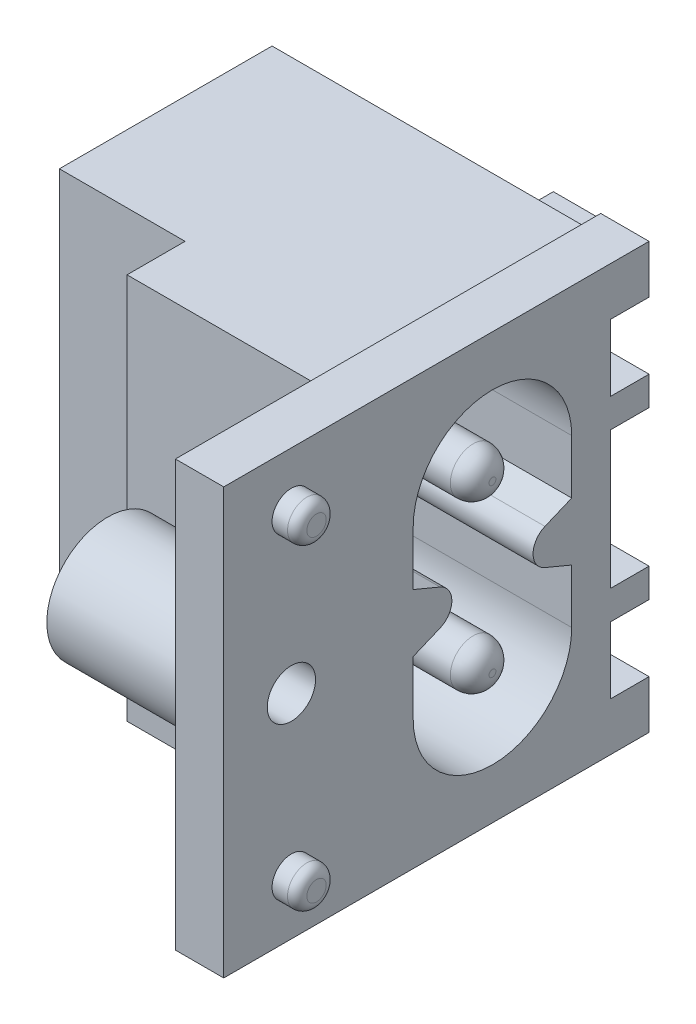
from build123d import *

# Parameters (mm, degrees)
BOSS_EXTRUDE1_DEPTH      = 22
SKETCH5_R                = 1.25
SKETCH5_R_2              = 1.18
CUT_EXTRUDE1_DEPTH       = 10
CUT_EXTRUDE2_DEPTH       = 32.388692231
CUT_EXTRUDE2_DEPTH_BACK  = 32.388692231
CUT_EXTRUDE3_START       = -2.5
CUT_EXTRUDE3_DEPTH       = 29.888692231
CUT_EXTRUDE4_START       = -17.81
CUT_EXTRUDE4_DEPTH       = 14.578692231
SKETCH9_W                = 3.8
SKETCH9_H                = 1.5
CUT_EXTRUDE5_DEPTH       = 2
CUT_EXTRUDE6_START       = -19.5
CUT_EXTRUDE6_DEPTH       = 6.19
BOSS_EXTRUDE2_DEPTH      = 2
BOSS_EXTRUDE2_DEPTH_BACK = 1.75
SKETCH12_W               = 3
SKETCH12_H               = 1
BOSS_EXTRUDE3_START      = -5.3
BOSS_EXTRUDE3_DEPTH      = 3
BOSS_EXTRUDE4_DEPTH      = 3
BOSS_EXTRUDE4_DEPTH_BACK = 4.1
SKETCH14_W               = 0.25
SKETCH14_H               = 1
FILLET1_R                = 1
FILLET2_R                = 0.4
SKETCH15_R               = 1
BOSS_EXTRUDE5_DEPTH      = 1.3
FILLET3_R                = 0.5


with BuildPart() as part:
    # Sketch1 → Boss-Extrude1 (new body)
    with BuildSketch(Plane.XY):
        Polygon((-19.5, 10), (-2.5, 10), (-2.5, 11), (0, 11), (0, -11), (-2.5, -11), (-2.5, -10), (-19.5, -10), align=None)
    extrude(amount=BOSS_EXTRUDE1_DEPTH)

    # Sketch5 → Cut-Extrude1 (cut)
    # profile 1 of 2: a face of its own
    with BuildSketch(Plane(origin=(0, 0, 0), x_dir=(0, 0, -1), z_dir=(1, 0, 0))):
        with Locations((-18.5, 0)):
            Circle(SKETCH5_R)
    # profile 2 of 2: a face of its own
    with BuildSketch(Plane(origin=(0, 0, 0), x_dir=(0, 0, -1), z_dir=(1, 0, 0))):
        with BuildLine():
            Line((-12.2, -4.3), (-12.2, -1.5))
            Line((-12.2, -1.5), (-10.815384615, -0.923076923))
            ThreePointArc((-10.815384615, -0.923076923), (-10.2, 0), (-10.815384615, 0.923076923))
            Line((-10.815384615, 0.923076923), (-12.2, 1.5))
            Line((-12.2, 1.5), (-12.2, 4.3))
            ThreePointArc((-12.2, 4.3), (-8.1, 8.4), (-4, 4.3))
            Line((-4, 4.3), (-4, 1.5))
            Line((-4, 1.5), (-5.384615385, 0.923076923))
            ThreePointArc((-5.384615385, 0.923076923), (-6, 0), (-5.384615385, -0.923076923))
            Line((-5.384615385, -0.923076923), (-4, -1.5))
            Line((-4, -1.5), (-4, -4.3))
            ThreePointArc((-4, -4.3), (-8.1, -8.4), (-12.2, -4.3))
        make_face()
        with Locations((-8.1, -4.3)):
            Circle(SKETCH5_R_2, mode=Mode.SUBTRACT)
        with Locations((-8.1, 4.3)):
            Circle(SKETCH5_R_2, mode=Mode.SUBTRACT)
    extrude(amount=-CUT_EXTRUDE1_DEPTH, mode=Mode.SUBTRACT)

    # Sketch6 → Cut-Extrude2 (cut, two sides: drawn at the far end of the back side and taken through both)
    with BuildSketch(Plane(origin=(0, 0, 0), x_dir=(1, 0, 0), z_dir=(0, 1, 0)).offset(-CUT_EXTRUDE2_DEPTH_BACK)):
        Polygon((-19.5, -22), (-2.5, -22), (-2.5, -21.8), (-9.5, -21.8), (-9.5, -14), (-13, -14), (-13, -11), (-19.5, -11), align=None)
    extrude(amount=CUT_EXTRUDE2_DEPTH + CUT_EXTRUDE2_DEPTH_BACK, mode=Mode.SUBTRACT)

    # Sketch7 → Cut-Extrude3 (cut, through all)
    with BuildSketch(Plane(origin=(0, 0, 0), x_dir=(0, 0, -1), z_dir=(1, 0, 0)).offset(CUT_EXTRUDE3_START)):
        with BuildLine():
            Line((-14, 0.75), (-15.440588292, 0.75))
            ThreePointArc((-15.440588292, 0.75), (-21.65, 0), (-15.440588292, -0.75))
            Line((-15.440588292, -0.75), (-14, -0.75))
            Line((-14, -0.75), (-14, -11))
            Line((-14, -11), (-22, -11))
            Line((-22, -11), (-22, 11))
            Line((-22, 11), (-14, 11))
            Line((-14, 11), (-14, 0.75))
        make_face()
    extrude(amount=-CUT_EXTRUDE3_DEPTH, mode=Mode.SUBTRACT)

    # Sketch8 → Cut-Extrude4 (cut, through all)
    with BuildSketch(Plane(origin=(0, 0, 0), x_dir=(0, 0, -1), z_dir=(1, 0, 0)).offset(CUT_EXTRUDE4_START)):
        Polygon((0, 8.5), (-9.5, 8.5), (-9.5, 0.75), (-1.8, 0.75), (-1.8, -0.75), (-9.5, -0.75), (-9.5, -8.5), (0, -8.5), align=None)
    extrude(amount=-CUT_EXTRUDE4_DEPTH, mode=Mode.SUBTRACT)

    # Sketch9 → Cut-Extrude5 (cut)
    with BuildSketch(Plane.XY):
        Polygon((-17.81, 8.5), (0, 8.5), (0, 5.05), (-13.31, 5.05), (-13.31, 6.5), (-17.81, 6.5), align=None)
        Polygon((-17.81, -8.5), (0, -8.5), (0, -5.05), (-13.31, -5.05), (-13.31, -6.5), (-17.81, -6.5), align=None)
        Polygon((0, 3.55), (0, -3.55), (-13.31, -3.55), (-13.31, -2.1), (-19.5, -2.1), (-19.5, 2.1), (-13.31, 2.1), (-13.31, 3.55), align=None)
        with Locations((-17.6, 4.3)):
            Rectangle(SKETCH9_W, SKETCH9_H)
        with Locations((-17.6, -4.3)):
            Rectangle(SKETCH9_W, SKETCH9_H)
    extrude(amount=CUT_EXTRUDE5_DEPTH, mode=Mode.SUBTRACT)

    # Sketch10 → Cut-Extrude6 (cut)
    with BuildSketch(Plane(origin=(0, 0, 0), x_dir=(0, 0, -1), z_dir=(1, 0, 0)).offset(CUT_EXTRUDE6_START)):
        Polygon((0, 6.5), (-7, 6.5), (-7, 2.1), (0, 2.1), (0, 0.75), (-9.5, 0.75), (-9.5, 8.5), (0, 8.5), align=None)
        Polygon((0, -8.5), (-9.5, -8.5), (-9.5, -0.75), (0, -0.75), (0, -2.1), (-7, -2.1), (-7, -6.5), (0, -6.5), align=None)
    extrude(amount=CUT_EXTRUDE6_DEPTH, mode=Mode.SUBTRACT)

    # Sketch12 → Boss-Extrude2 (add, two sides: drawn at the far end of the back side and taken through both)
    with BuildSketch(Plane.XY.offset(-BOSS_EXTRUDE2_DEPTH_BACK)):
        with Locations((-6.8, 6.9)):
            Rectangle(SKETCH12_W, SKETCH12_H)
        with Locations((-6.8, -6.9)):
            Rectangle(SKETCH12_W, SKETCH12_H)
    extrude(amount=BOSS_EXTRUDE2_DEPTH + BOSS_EXTRUDE2_DEPTH_BACK)

    # Sketch13 → Boss-Extrude3 (add)
    with BuildSketch(Plane(origin=(0, 0, 0), x_dir=(0, 0, -1), z_dir=(1, 0, 0)).offset(BOSS_EXTRUDE3_START)):
        Polygon((1.75, 7.4), (3.35, 7.4), (3.35, 7), (1.75, 5.8), align=None)
        Polygon((1.75, -7.4), (3.35, -7.4), (3.35, -7), (1.75, -5.8), align=None)
    extrude(amount=-BOSS_EXTRUDE3_DEPTH)

    # Sketch14 → Boss-Extrude4 (add, two sides: drawn at the far end of the back side and taken through both)
    with BuildSketch(Plane.XY.offset(-BOSS_EXTRUDE4_DEPTH_BACK)):
        with Locations((-15.7, 4.3)):
            Rectangle(SKETCH14_W, SKETCH14_H)
        with Locations((-15.7, -4.3)):
            Rectangle(SKETCH14_W, SKETCH14_H)
    extrude(amount=BOSS_EXTRUDE4_DEPTH + BOSS_EXTRUDE4_DEPTH_BACK)

    # Fillet1
    fillet1_edges = [part.edges().sort_by_distance(p)[0] for p in [
        (0, -4.3, 9.28),
        (0, 4.3, 9.28),
    ]]
    fillet(fillet1_edges, radius=FILLET1_R)

    # Fillet2
    fillet2_edges = [part.edges().sort_by_distance(p)[0] for p in [
        (-15.7, 4.8, -4.1),
        (-15.7, 3.8, -4.1),
        (-15.7, -3.8, -4.1),
        (-15.7, -4.8, -4.1),
    ]]
    fillet(fillet2_edges, radius=FILLET2_R)

    # Sketch15 → Boss-Extrude5 (add)
    with BuildSketch(Plane(origin=(0, 0, 0), x_dir=(0, 0, -1), z_dir=(1, 0, 0))):
        with Locations(Location((-18.5, 8.191257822, 0), (0, 0, 270))):
            Circle(SKETCH15_R)
        with Locations(Location((-18.5, -8.191257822, 0), (0, 0, 270))):
            Circle(SKETCH15_R)
    extrude(amount=BOSS_EXTRUDE5_DEPTH)

    # Fillet3
    fillet3_edges = [part.edges().sort_by_distance(p)[0] for p in [
        (1.3, 9.191257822, 18.5),
        (1.3, -7.191257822, 18.5),
    ]]
    fillet(fillet3_edges, radius=FILLET3_R)


solid = part.part
